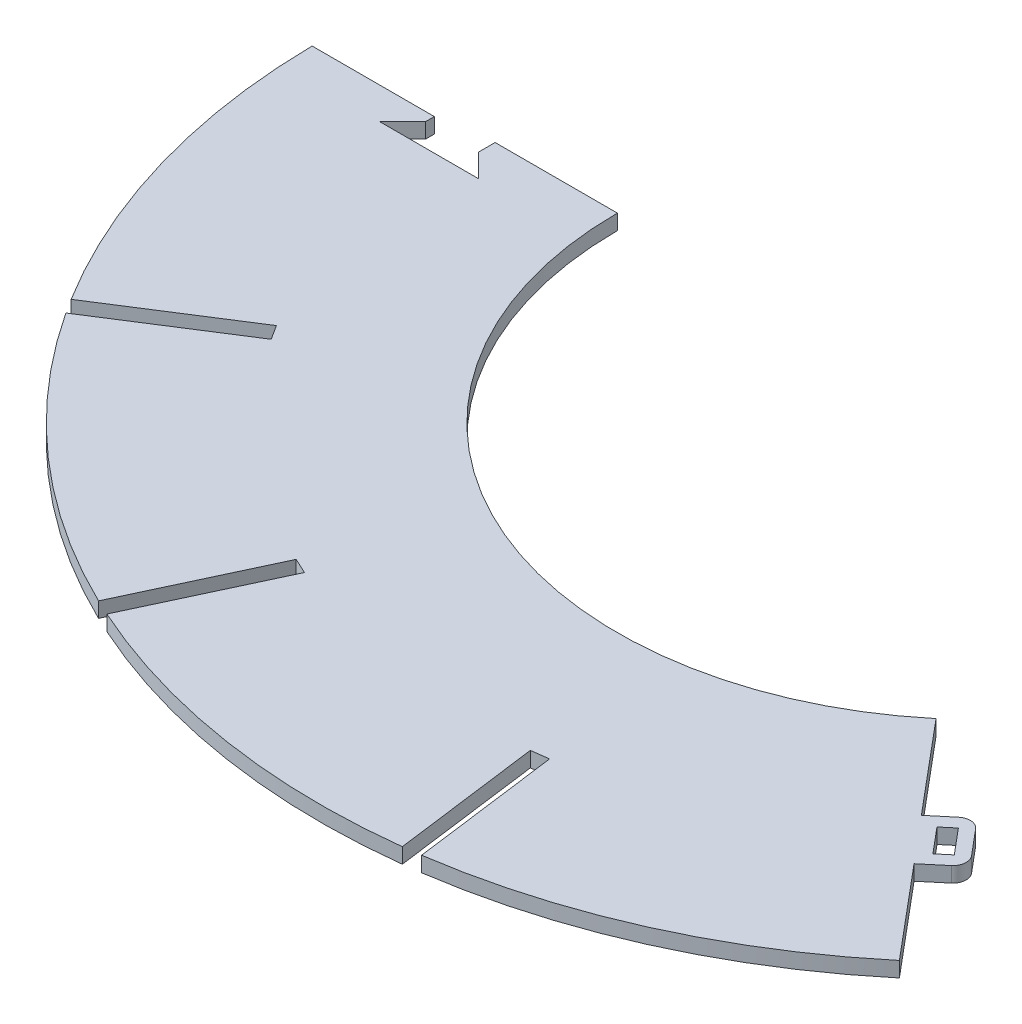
ISO-10303-21;
HEADER;
FILE_DESCRIPTION(('STEP AP214'),'2;1');
FILE_NAME('part.step','',(''),(''),'','','');
FILE_SCHEMA(('AUTOMOTIVE_DESIGN { 1 0 10303 214 1 1 1 1 }'));
ENDSEC;
DATA;
#1=APPLICATION_CONTEXT('core data for automotive mechanical design processes');
#2=APPLICATION_PROTOCOL_DEFINITION('international standard','automotive_design',2000,#1);
#3=PRODUCT_CONTEXT('',#1,'mechanical');
#4=PRODUCT('Part','Part','',(#3));
#5=PRODUCT_RELATED_PRODUCT_CATEGORY('part','',(#4));
#6=PRODUCT_DEFINITION_FORMATION('','',#4);
#7=PRODUCT_DEFINITION_CONTEXT('part definition',#1,'design');
#8=PRODUCT_DEFINITION('design','',#6,#7);
#9=PRODUCT_DEFINITION_SHAPE('','',#8);
#10=(LENGTH_UNIT() NAMED_UNIT(*) SI_UNIT(.MILLI.,.METRE.));
#11=(NAMED_UNIT(*) PLANE_ANGLE_UNIT() SI_UNIT($,.RADIAN.));
#12=(NAMED_UNIT(*) SI_UNIT($,.STERADIAN.) SOLID_ANGLE_UNIT());
#13=UNCERTAINTY_MEASURE_WITH_UNIT(LENGTH_MEASURE(1.E-05),#10,'distance_accuracy_value','');
#14=(GEOMETRIC_REPRESENTATION_CONTEXT(3) GLOBAL_UNCERTAINTY_ASSIGNED_CONTEXT((#13)) GLOBAL_UNIT_ASSIGNED_CONTEXT((#10,
#11,#12)) REPRESENTATION_CONTEXT('',''));
#15=CARTESIAN_POINT('',(0.,0.,0.));
#16=DIRECTION('',(0.,0.,1.));
#17=DIRECTION('',(1.,0.,0.));
#18=AXIS2_PLACEMENT_3D('',#15,#16,#17);
#19=CARTESIAN_POINT('',(264.895793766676,23.,315.690513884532));
#20=DIRECTION('',(0.642787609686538,0.,0.766044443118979));
#21=DIRECTION('',(0.766044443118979,0.,-0.642787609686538));
#22=AXIS2_PLACEMENT_3D('',#19,#20,#21);
#23=PLANE('',#22);
#24=DIRECTION('',(-0.766044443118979,0.,0.642787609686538));
#25=VECTOR('',#24,1.);
#26=CARTESIAN_POINT('',(264.895793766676,0.,315.690513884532));
#27=LINE('',#26,#25);
#28=CARTESIAN_POINT('',(487.499812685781,0.,128.903563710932));
#29=VERTEX_POINT('',#28);
#30=CARTESIAN_POINT('',(469.880790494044,0.,143.687678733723));
#31=VERTEX_POINT('',#30);
#32=EDGE_CURVE('E351',#29,#31,#27,.T.);
#33=ORIENTED_EDGE('',*,*,#32,.F.);
#34=DIRECTION('',(0.,-1.,0.));
#35=VECTOR('',#34,1.);
#36=CARTESIAN_POINT('',(487.499812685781,23.,128.903563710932));
#37=LINE('',#36,#35);
#38=CARTESIAN_POINT('',(487.499812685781,23.,128.903563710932));
#39=VERTEX_POINT('',#38);
#40=EDGE_CURVE('E11',#39,#29,#37,.T.);
#41=ORIENTED_EDGE('',*,*,#40,.F.);
#42=DIRECTION('',(-0.766044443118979,0.,0.642787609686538));
#43=VECTOR('',#42,1.);
#44=CARTESIAN_POINT('',(264.895793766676,23.,315.690513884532));
#45=LINE('',#44,#43);
#46=CARTESIAN_POINT('',(469.880790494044,23.,143.687678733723));
#47=VERTEX_POINT('',#46);
#48=EDGE_CURVE('E257',#39,#47,#45,.T.);
#49=ORIENTED_EDGE('',*,*,#48,.T.);
#50=DIRECTION('',(0.,-1.,0.));
#51=VECTOR('',#50,1.);
#52=CARTESIAN_POINT('',(469.880790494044,23.,143.687678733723));
#53=LINE('',#52,#51);
#54=EDGE_CURVE('E53',#47,#31,#53,.T.);
#55=ORIENTED_EDGE('',*,*,#54,.T.);
#56=EDGE_LOOP('',(#33,#41,#49,#55));
#57=FACE_BOUND('',#56,.T.);
#58=ADVANCED_FACE('F34',(#57),#23,.T.);
#59=CARTESIAN_POINT('',(222.604018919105,23.,-186.7869501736));
#60=DIRECTION('',(0.766044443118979,0.,-0.642787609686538));
#61=DIRECTION('',(-0.642787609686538,0.,-0.766044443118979));
#62=AXIS2_PLACEMENT_3D('',#59,#60,#61);
#63=PLANE('',#62);
#64=DIRECTION('',(0.642787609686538,0.,0.766044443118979));
#65=VECTOR('',#64,1.);
#66=CARTESIAN_POINT('',(222.604018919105,0.,-186.7869501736));
#67=LINE('',#66,#65);
#68=CARTESIAN_POINT('',(519.639193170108,0.,167.205785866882));
#69=VERTEX_POINT('',#68);
#70=EDGE_CURVE('E263',#29,#69,#67,.T.);
#71=ORIENTED_EDGE('',*,*,#70,.T.);
#72=DIRECTION('',(0.,-1.,0.));
#73=VECTOR('',#72,1.);
#74=CARTESIAN_POINT('',(519.639193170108,23.,167.205785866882));
#75=LINE('',#74,#73);
#76=CARTESIAN_POINT('',(519.639193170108,23.,167.205785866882));
#77=VERTEX_POINT('',#76);
#78=EDGE_CURVE('E44',#77,#69,#75,.T.);
#79=ORIENTED_EDGE('',*,*,#78,.F.);
#80=DIRECTION('',(0.642787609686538,0.,0.766044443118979));
#81=VECTOR('',#80,1.);
#82=CARTESIAN_POINT('',(222.604018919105,23.,-186.7869501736));
#83=LINE('',#82,#81);
#84=EDGE_CURVE('E251',#39,#77,#83,.T.);
#85=ORIENTED_EDGE('',*,*,#84,.F.);
#86=ORIENTED_EDGE('',*,*,#40,.T.);
#87=EDGE_LOOP('',(#71,#79,#85,#86));
#88=FACE_BOUND('',#87,.T.);
#89=ADVANCED_FACE('F261',(#88),#63,.F.);
#90=CARTESIAN_POINT('',(297.035174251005,23.,353.992736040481));
#91=DIRECTION('',(-0.64278760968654,0.,-0.766044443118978));
#92=DIRECTION('',(-0.766044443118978,0.,0.64278760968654));
#93=AXIS2_PLACEMENT_3D('',#90,#91,#92);
#94=PLANE('',#93);
#95=DIRECTION('',(0.766044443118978,0.,-0.64278760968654));
#96=VECTOR('',#95,1.);
#97=CARTESIAN_POINT('',(297.035174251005,0.,353.992736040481));
#98=LINE('',#97,#96);
#99=CARTESIAN_POINT('',(502.020170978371,0.,181.989900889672));
#100=VERTEX_POINT('',#99);
#101=EDGE_CURVE('E354',#100,#69,#98,.T.);
#102=ORIENTED_EDGE('',*,*,#101,.F.);
#103=DIRECTION('',(0.,-1.,0.));
#104=VECTOR('',#103,1.);
#105=CARTESIAN_POINT('',(502.020170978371,23.,181.989900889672));
#106=LINE('',#105,#104);
#107=CARTESIAN_POINT('',(502.020170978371,23.,181.989900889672));
#108=VERTEX_POINT('',#107);
#109=EDGE_CURVE('E150',#108,#100,#106,.T.);
#110=ORIENTED_EDGE('',*,*,#109,.F.);
#111=DIRECTION('',(0.766044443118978,0.,-0.64278760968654));
#112=VECTOR('',#111,1.);
#113=CARTESIAN_POINT('',(297.035174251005,23.,353.992736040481));
#114=LINE('',#113,#112);
#115=EDGE_CURVE('E256',#108,#77,#114,.T.);
#116=ORIENTED_EDGE('',*,*,#115,.T.);
#117=ORIENTED_EDGE('',*,*,#78,.T.);
#118=EDGE_LOOP('',(#102,#110,#116,#117));
#119=FACE_BOUND('',#118,.T.);
#120=ADVANCED_FACE('F267',(#119),#94,.T.);
#121=CARTESIAN_POINT('',(-26.3817389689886,23.,-418.95408282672));
#122=DIRECTION('',(0.,-1.,0.));
#123=DIRECTION('',(0.,0.,-1.));
#124=AXIS2_PLACEMENT_3D('',#121,#122,#123);
#125=CYLINDRICAL_SURFACE('',#124,1000.);
#126=CARTESIAN_POINT('',(-26.3817389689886,0.,-418.95408282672));
#127=DIRECTION('',(0.,1.,0.));
#128=DIRECTION('',(0.,0.,1.));
#129=AXIS2_PLACEMENT_3D('',#126,#127,#128);
#130=CIRCLE('',#129,1000.);
#131=CARTESIAN_POINT('',(-876.686810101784,0.,107.336032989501));
#132=VERTEX_POINT('',#131);
#133=CARTESIAN_POINT('',(-1026.30973637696,0.,-406.954082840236));
#134=VERTEX_POINT('',#133);
#135=EDGE_CURVE('E274',#132,#134,#130,.F.);
#136=ORIENTED_EDGE('',*,*,#135,.F.);
#137=DIRECTION('',(0.,-1.,0.));
#138=VECTOR('',#137,1.);
#139=CARTESIAN_POINT('',(-876.686810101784,23.,107.336032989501));
#140=LINE('',#139,#138);
#141=CARTESIAN_POINT('',(-876.686810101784,23.,107.336032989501));
#142=VERTEX_POINT('',#141);
#143=EDGE_CURVE('E38',#142,#132,#140,.T.);
#144=ORIENTED_EDGE('',*,*,#143,.F.);
#145=CARTESIAN_POINT('',(-26.3817389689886,23.,-418.95408282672));
#146=DIRECTION('',(0.,1.,0.));
#147=DIRECTION('',(0.,0.,1.));
#148=AXIS2_PLACEMENT_3D('',#145,#146,#147);
#149=CIRCLE('',#148,1000.);
#150=CARTESIAN_POINT('',(-1026.30973637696,23.,-406.954082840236));
#151=VERTEX_POINT('',#150);
#152=EDGE_CURVE('E359',#142,#151,#149,.F.);
#153=ORIENTED_EDGE('',*,*,#152,.T.);
#154=DIRECTION('',(0.,-1.,0.));
#155=VECTOR('',#154,1.);
#156=CARTESIAN_POINT('',(-1026.30973637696,23.,-406.954082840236));
#157=LINE('',#156,#155);
#158=EDGE_CURVE('E270',#151,#134,#157,.T.);
#159=ORIENTED_EDGE('',*,*,#158,.T.);
#160=EDGE_LOOP('',(#136,#144,#153,#159));
#161=FACE_BOUND('',#160,.T.);
#162=ADVANCED_FACE('F36',(#161),#125,.T.);
#163=CARTESIAN_POINT('',(-204.451735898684,23.,-320.92494105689));
#164=DIRECTION('',(0.537299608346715,0.,0.843391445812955));
#165=DIRECTION('',(0.843391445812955,0.,-0.537299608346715));
#166=AXIS2_PLACEMENT_3D('',#163,#164,#165);
#167=PLANE('',#166);
#168=DIRECTION('',(-0.843391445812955,0.,0.537299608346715));
#169=VECTOR('',#168,1.);
#170=CARTESIAN_POINT('',(-204.451735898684,0.,-320.92494105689));
#171=LINE('',#170,#169);
#172=CARTESIAN_POINT('',(-686.909718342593,0.,-13.56530835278));
#173=VERTEX_POINT('',#172);
#174=EDGE_CURVE('E277',#173,#132,#171,.T.);
#175=ORIENTED_EDGE('',*,*,#174,.F.);
#176=DIRECTION('',(0.,-1.,0.));
#177=VECTOR('',#176,1.);
#178=CARTESIAN_POINT('',(-686.909718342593,23.,-13.56530835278));
#179=LINE('',#178,#177);
#180=CARTESIAN_POINT('',(-686.909718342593,23.,-13.56530835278));
#181=VERTEX_POINT('',#180);
#182=EDGE_CURVE('E419',#181,#173,#179,.T.);
#183=ORIENTED_EDGE('',*,*,#182,.F.);
#184=DIRECTION('',(-0.843391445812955,0.,0.537299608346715));
#185=VECTOR('',#184,1.);
#186=CARTESIAN_POINT('',(-204.451735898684,23.,-320.92494105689));
#187=LINE('',#186,#185);
#188=EDGE_CURVE('E428',#181,#142,#187,.T.);
#189=ORIENTED_EDGE('',*,*,#188,.T.);
#190=ORIENTED_EDGE('',*,*,#143,.T.);
#191=EDGE_LOOP('',(#175,#183,#189,#190));
#192=FACE_BOUND('',#191,.T.);
#193=ADVANCED_FACE('F426',(#192),#167,.T.);
#194=CARTESIAN_POINT('',(-482.847053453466,23.,307.187186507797));
#195=DIRECTION('',(0.843724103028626,0.,-0.536777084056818));
#196=DIRECTION('',(-0.536777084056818,0.,-0.843724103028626));
#197=AXIS2_PLACEMENT_3D('',#194,#195,#196);
#198=PLANE('',#197);
#199=DIRECTION('',(0.536777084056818,0.,0.843724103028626));
#200=VECTOR('',#199,1.);
#201=CARTESIAN_POINT('',(-482.847053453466,0.,307.187186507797));
#202=LINE('',#201,#200);
#203=CARTESIAN_POINT('',(-672.953511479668,0.,8.37152253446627));
#204=VERTEX_POINT('',#203);
#205=EDGE_CURVE('E280',#173,#204,#202,.T.);
#206=ORIENTED_EDGE('',*,*,#205,.T.);
#207=DIRECTION('',(0.,-1.,0.));
#208=VECTOR('',#207,1.);
#209=CARTESIAN_POINT('',(-672.953511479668,23.,8.37152253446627));
#210=LINE('',#209,#208);
#211=CARTESIAN_POINT('',(-672.953511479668,23.,8.37152253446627));
#212=VERTEX_POINT('',#211);
#213=EDGE_CURVE('E417',#212,#204,#210,.T.);
#214=ORIENTED_EDGE('',*,*,#213,.F.);
#215=DIRECTION('',(0.536777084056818,0.,0.843724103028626));
#216=VECTOR('',#215,1.);
#217=CARTESIAN_POINT('',(-482.847053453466,23.,307.187186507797));
#218=LINE('',#217,#216);
#219=EDGE_CURVE('E446',#181,#212,#218,.T.);
#220=ORIENTED_EDGE('',*,*,#219,.F.);
#221=ORIENTED_EDGE('',*,*,#182,.T.);
#222=EDGE_LOOP('',(#206,#214,#220,#221));
#223=FACE_BOUND('',#222,.T.);
#224=ADVANCED_FACE('F436',(#223),#198,.F.);
#225=CARTESIAN_POINT('',(-190.481946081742,23.,-298.996763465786));
#226=DIRECTION('',(0.537299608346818,0.,0.843391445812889));
#227=DIRECTION('',(0.843391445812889,0.,-0.537299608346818));
#228=AXIS2_PLACEMENT_3D('',#225,#226,#227);
#229=PLANE('',#228);
#230=DIRECTION('',(-0.843391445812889,0.,0.537299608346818));
#231=VECTOR('',#230,1.);
#232=CARTESIAN_POINT('',(-190.481946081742,0.,-298.996763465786));
#233=LINE('',#232,#231);
#234=CARTESIAN_POINT('',(-862.717020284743,0.,129.264210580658));
#235=VERTEX_POINT('',#234);
#236=EDGE_CURVE('E282',#204,#235,#233,.T.);
#237=ORIENTED_EDGE('',*,*,#236,.T.);
#238=DIRECTION('',(0.,-1.,0.));
#239=VECTOR('',#238,1.);
#240=CARTESIAN_POINT('',(-862.717020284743,23.,129.264210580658));
#241=LINE('',#240,#239);
#242=CARTESIAN_POINT('',(-862.717020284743,23.,129.264210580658));
#243=VERTEX_POINT('',#242);
#244=EDGE_CURVE('E415',#243,#235,#241,.T.);
#245=ORIENTED_EDGE('',*,*,#244,.F.);
#246=DIRECTION('',(-0.843391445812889,0.,0.537299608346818));
#247=VECTOR('',#246,1.);
#248=CARTESIAN_POINT('',(-190.481946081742,23.,-298.996763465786));
#249=LINE('',#248,#247);
#250=EDGE_CURVE('E441',#212,#243,#249,.T.);
#251=ORIENTED_EDGE('',*,*,#250,.F.);
#252=ORIENTED_EDGE('',*,*,#213,.T.);
#253=EDGE_LOOP('',(#237,#245,#251,#252));
#254=FACE_BOUND('',#253,.T.);
#255=ADVANCED_FACE('F439',(#254),#229,.F.);
#256=CARTESIAN_POINT('',(-26.3817389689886,23.,-418.95408282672));
#257=DIRECTION('',(0.,-1.,0.));
#258=DIRECTION('',(0.,0.,-1.));
#259=AXIS2_PLACEMENT_3D('',#256,#257,#258);
#260=CYLINDRICAL_SURFACE('',#259,1000.);
#261=CARTESIAN_POINT('',(-26.3817389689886,0.,-418.95408282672));
#262=DIRECTION('',(0.,1.,0.));
#263=DIRECTION('',(0.,0.,1.));
#264=AXIS2_PLACEMENT_3D('',#261,#262,#263);
#265=CIRCLE('',#264,1000.);
#266=CARTESIAN_POINT('',(-460.746289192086,0.,481.78308056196));
#267=VERTEX_POINT('',#266);
#268=EDGE_CURVE('E285',#267,#235,#265,.F.);
#269=ORIENTED_EDGE('',*,*,#268,.F.);
#270=DIRECTION('',(0.,-1.,0.));
#271=VECTOR('',#270,1.);
#272=CARTESIAN_POINT('',(-460.746289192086,23.,481.78308056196));
#273=LINE('',#272,#271);
#274=CARTESIAN_POINT('',(-460.746289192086,23.,481.78308056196));
#275=VERTEX_POINT('',#274);
#276=EDGE_CURVE('E413',#275,#267,#273,.T.);
#277=ORIENTED_EDGE('',*,*,#276,.F.);
#278=CARTESIAN_POINT('',(-26.3817389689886,23.,-418.95408282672));
#279=DIRECTION('',(0.,1.,0.));
#280=DIRECTION('',(0.,0.,1.));
#281=AXIS2_PLACEMENT_3D('',#278,#279,#280);
#282=CIRCLE('',#281,1000.);
#283=EDGE_CURVE('E445',#275,#243,#282,.F.);
#284=ORIENTED_EDGE('',*,*,#283,.T.);
#285=ORIENTED_EDGE('',*,*,#244,.T.);
#286=EDGE_LOOP('',(#269,#277,#284,#285));
#287=FACE_BOUND('',#286,.T.);
#288=ADVANCED_FACE('F615',(#287),#260,.T.);
#289=CARTESIAN_POINT('',(-193.920521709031,23.,-90.4266243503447));
#290=DIRECTION('',(0.90630778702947,0.,0.422618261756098));
#291=DIRECTION('',(0.422618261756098,0.,-0.90630778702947));
#292=AXIS2_PLACEMENT_3D('',#289,#290,#291);
#293=PLANE('',#292);
#294=DIRECTION('',(-0.422618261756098,0.,0.90630778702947));
#295=VECTOR('',#294,1.);
#296=CARTESIAN_POINT('',(-193.920521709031,0.,-90.4266243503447));
#297=LINE('',#296,#295);
#298=CARTESIAN_POINT('',(-365.650287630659,0.,277.849047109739));
#299=VERTEX_POINT('',#298);
#300=EDGE_CURVE('E288',#299,#267,#297,.T.);
#301=ORIENTED_EDGE('',*,*,#300,.F.);
#302=DIRECTION('',(0.,-1.,0.));
#303=VECTOR('',#302,1.);
#304=CARTESIAN_POINT('',(-365.650287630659,23.,277.849047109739));
#305=LINE('',#304,#303);
#306=CARTESIAN_POINT('',(-365.650287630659,23.,277.849047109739));
#307=VERTEX_POINT('',#306);
#308=EDGE_CURVE('E411',#307,#299,#305,.T.);
#309=ORIENTED_EDGE('',*,*,#308,.F.);
#310=DIRECTION('',(-0.422618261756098,0.,0.90630778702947));
#311=VECTOR('',#310,1.);
#312=CARTESIAN_POINT('',(-193.920521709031,23.,-90.4266243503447));
#313=LINE('',#312,#311);
#314=EDGE_CURVE('E448',#307,#275,#313,.T.);
#315=ORIENTED_EDGE('',*,*,#314,.T.);
#316=ORIENTED_EDGE('',*,*,#276,.T.);
#317=EDGE_LOOP('',(#301,#309,#315,#316));
#318=FACE_BOUND('',#317,.T.);
#319=ADVANCED_FACE('F611',(#318),#293,.T.);
#320=CARTESIAN_POINT('',(-171.72976591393,23.,368.275671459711));
#321=DIRECTION('',(0.422618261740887,0.,-0.906307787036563));
#322=DIRECTION('',(-0.906307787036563,0.,-0.422618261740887));
#323=AXIS2_PLACEMENT_3D('',#320,#321,#322);
#324=PLANE('',#323);
#325=DIRECTION('',(0.906307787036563,0.,0.422618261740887));
#326=VECTOR('',#325,1.);
#327=CARTESIAN_POINT('',(-171.72976591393,0.,368.275671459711));
#328=LINE('',#327,#326);
#329=CARTESIAN_POINT('',(-342.086285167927,0.,288.8371219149));
#330=VERTEX_POINT('',#329);
#331=EDGE_CURVE('E291',#299,#330,#328,.T.);
#332=ORIENTED_EDGE('',*,*,#331,.T.);
#333=DIRECTION('',(0.,-1.,0.));
#334=VECTOR('',#333,1.);
#335=CARTESIAN_POINT('',(-342.086285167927,23.,288.8371219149));
#336=LINE('',#335,#334);
#337=CARTESIAN_POINT('',(-342.086285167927,23.,288.8371219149));
#338=VERTEX_POINT('',#337);
#339=EDGE_CURVE('E408',#338,#330,#336,.T.);
#340=ORIENTED_EDGE('',*,*,#339,.F.);
#341=DIRECTION('',(0.906307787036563,0.,0.422618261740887));
#342=VECTOR('',#341,1.);
#343=CARTESIAN_POINT('',(-171.72976591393,23.,368.275671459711));
#344=LINE('',#343,#342);
#345=EDGE_CURVE('E455',#307,#338,#344,.T.);
#346=ORIENTED_EDGE('',*,*,#345,.F.);
#347=ORIENTED_EDGE('',*,*,#308,.T.);
#348=EDGE_LOOP('',(#332,#340,#346,#347));
#349=FACE_BOUND('',#348,.T.);
#350=ADVANCED_FACE('F607',(#349),#324,.F.);
#351=CARTESIAN_POINT('',(-170.356519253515,23.,-79.4385495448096));
#352=DIRECTION('',(0.906307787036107,0.,0.422618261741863));
#353=DIRECTION('',(0.422618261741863,0.,-0.906307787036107));
#354=AXIS2_PLACEMENT_3D('',#351,#352,#353);
#355=PLANE('',#354);
#356=DIRECTION('',(-0.422618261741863,0.,0.906307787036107));
#357=VECTOR('',#356,1.);
#358=CARTESIAN_POINT('',(-170.356519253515,0.,-79.4385495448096));
#359=LINE('',#358,#357);
#360=CARTESIAN_POINT('',(-437.182286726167,0.,492.771155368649));
#361=VERTEX_POINT('',#360);
#362=EDGE_CURVE('E293',#330,#361,#359,.T.);
#363=ORIENTED_EDGE('',*,*,#362,.T.);
#364=DIRECTION('',(0.,-1.,0.));
#365=VECTOR('',#364,1.);
#366=CARTESIAN_POINT('',(-437.182286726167,23.,492.771155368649));
#367=LINE('',#366,#365);
#368=CARTESIAN_POINT('',(-437.182286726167,23.,492.771155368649));
#369=VERTEX_POINT('',#368);
#370=EDGE_CURVE('E406',#369,#361,#367,.T.);
#371=ORIENTED_EDGE('',*,*,#370,.F.);
#372=DIRECTION('',(-0.422618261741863,0.,0.906307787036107));
#373=VECTOR('',#372,1.);
#374=CARTESIAN_POINT('',(-170.356519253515,23.,-79.4385495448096));
#375=LINE('',#374,#373);
#376=EDGE_CURVE('E457',#338,#369,#375,.T.);
#377=ORIENTED_EDGE('',*,*,#376,.F.);
#378=ORIENTED_EDGE('',*,*,#339,.T.);
#379=EDGE_LOOP('',(#363,#371,#377,#378));
#380=FACE_BOUND('',#379,.T.);
#381=ADVANCED_FACE('F603',(#380),#355,.F.);
#382=CARTESIAN_POINT('',(-26.3817389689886,23.,-418.95408282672));
#383=DIRECTION('',(0.,-1.,0.));
#384=DIRECTION('',(0.,0.,-1.));
#385=AXIS2_PLACEMENT_3D('',#382,#383,#384);
#386=CYLINDRICAL_SURFACE('',#385,1000.);
#387=CARTESIAN_POINT('',(-26.3817389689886,0.,-418.95408282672));
#388=DIRECTION('',(0.,1.,0.));
#389=DIRECTION('',(0.,0.,1.));
#390=AXIS2_PLACEMENT_3D('',#387,#388,#389);
#391=CIRCLE('',#390,1000.);
#392=CARTESIAN_POINT('',(91.2446401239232,0.,574.103838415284));
#393=VERTEX_POINT('',#392);
#394=EDGE_CURVE('E296',#393,#361,#391,.F.);
#395=ORIENTED_EDGE('',*,*,#394,.F.);
#396=DIRECTION('',(0.,-1.,0.));
#397=VECTOR('',#396,1.);
#398=CARTESIAN_POINT('',(91.2446401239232,23.,574.103838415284));
#399=LINE('',#398,#397);
#400=CARTESIAN_POINT('',(91.2446401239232,23.,574.103838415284));
#401=VERTEX_POINT('',#400);
#402=EDGE_CURVE('E404',#401,#393,#399,.T.);
#403=ORIENTED_EDGE('',*,*,#402,.F.);
#404=CARTESIAN_POINT('',(-26.3817389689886,23.,-418.95408282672));
#405=DIRECTION('',(0.,1.,0.));
#406=DIRECTION('',(0.,0.,1.));
#407=AXIS2_PLACEMENT_3D('',#404,#405,#406);
#408=CIRCLE('',#407,1000.);
#409=EDGE_CURVE('E459',#401,#369,#408,.F.);
#410=ORIENTED_EDGE('',*,*,#409,.T.);
#411=ORIENTED_EDGE('',*,*,#370,.T.);
#412=EDGE_LOOP('',(#395,#403,#410,#411));
#413=FACE_BOUND('',#412,.T.);
#414=ADVANCED_FACE('F599',(#413),#386,.T.);
#415=CARTESIAN_POINT('',(15.3955936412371,23.,-2.02686835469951));
#416=DIRECTION('',(0.991444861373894,0.,-0.130526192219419));
#417=DIRECTION('',(-0.130526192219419,0.,-0.991444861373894));
#418=AXIS2_PLACEMENT_3D('',#415,#416,#417);
#419=PLANE('',#418);
#420=DIRECTION('',(0.130526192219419,0.,0.991444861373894));
#421=VECTOR('',#420,1.);
#422=CARTESIAN_POINT('',(15.3955936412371,0.,-2.02686835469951));
#423=LINE('',#422,#421);
#424=CARTESIAN_POINT('',(61.8741180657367,0.,351.01257469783));
#425=VERTEX_POINT('',#424);
#426=EDGE_CURVE('E299',#425,#393,#423,.T.);
#427=ORIENTED_EDGE('',*,*,#426,.F.);
#428=DIRECTION('',(0.,-1.,0.));
#429=VECTOR('',#428,1.);
#430=CARTESIAN_POINT('',(61.8741180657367,23.,351.01257469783));
#431=LINE('',#430,#429);
#432=CARTESIAN_POINT('',(61.8741180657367,23.,351.01257469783));
#433=VERTEX_POINT('',#432);
#434=EDGE_CURVE('E402',#433,#425,#431,.T.);
#435=ORIENTED_EDGE('',*,*,#434,.F.);
#436=DIRECTION('',(0.130526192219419,0.,0.991444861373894));
#437=VECTOR('',#436,1.);
#438=CARTESIAN_POINT('',(15.3955936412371,23.,-2.02686835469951));
#439=LINE('',#438,#437);
#440=EDGE_CURVE('E462',#433,#401,#439,.T.);
#441=ORIENTED_EDGE('',*,*,#440,.T.);
#442=ORIENTED_EDGE('',*,*,#402,.T.);
#443=EDGE_LOOP('',(#427,#435,#441,#442));
#444=FACE_BOUND('',#443,.T.);
#445=ADVANCED_FACE('F595',(#444),#419,.T.);
#446=CARTESIAN_POINT('',(46.4785244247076,23.,353.039443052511));
#447=DIRECTION('',(-0.13052619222,0.,-0.991444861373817));
#448=DIRECTION('',(-0.991444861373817,0.,0.13052619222));
#449=AXIS2_PLACEMENT_3D('',#446,#447,#448);
#450=PLANE('',#449);
#451=DIRECTION('',(0.991444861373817,0.,-0.13052619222));
#452=VECTOR('',#451,1.);
#453=CARTESIAN_POINT('',(46.4785244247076,0.,353.039443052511));
#454=LINE('',#453,#452);
#455=CARTESIAN_POINT('',(87.6516844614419,0.,347.618893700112));
#456=VERTEX_POINT('',#455);
#457=EDGE_CURVE('E302',#425,#456,#454,.T.);
#458=ORIENTED_EDGE('',*,*,#457,.T.);
#459=DIRECTION('',(0.,-1.,0.));
#460=VECTOR('',#459,1.);
#461=CARTESIAN_POINT('',(87.6516844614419,23.,347.618893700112));
#462=LINE('',#461,#460);
#463=CARTESIAN_POINT('',(87.6516844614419,23.,347.618893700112));
#464=VERTEX_POINT('',#463);
#465=EDGE_CURVE('E399',#464,#456,#462,.T.);
#466=ORIENTED_EDGE('',*,*,#465,.F.);
#467=DIRECTION('',(0.991444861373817,0.,-0.13052619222));
#468=VECTOR('',#467,1.);
#469=CARTESIAN_POINT('',(46.4785244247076,23.,353.039443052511));
#470=LINE('',#469,#468);
#471=EDGE_CURVE('E465',#433,#464,#470,.T.);
#472=ORIENTED_EDGE('',*,*,#471,.F.);
#473=ORIENTED_EDGE('',*,*,#434,.T.);
#474=EDGE_LOOP('',(#458,#466,#472,#473));
#475=FACE_BOUND('',#474,.T.);
#476=ADVANCED_FACE('F591',(#475),#450,.F.);
#477=CARTESIAN_POINT('',(41.1731600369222,23.,-5.42054935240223));
#478=DIRECTION('',(0.991444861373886,0.,-0.13052619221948));
#479=DIRECTION('',(-0.13052619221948,0.,-0.991444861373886));
#480=AXIS2_PLACEMENT_3D('',#477,#478,#479);
#481=PLANE('',#480);
#482=DIRECTION('',(0.13052619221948,0.,0.991444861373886));
#483=VECTOR('',#482,1.);
#484=CARTESIAN_POINT('',(41.1731600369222,0.,-5.42054935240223));
#485=LINE('',#484,#483);
#486=CARTESIAN_POINT('',(117.022206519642,0.,570.710157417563));
#487=VERTEX_POINT('',#486);
#488=EDGE_CURVE('E304',#456,#487,#485,.T.);
#489=ORIENTED_EDGE('',*,*,#488,.T.);
#490=DIRECTION('',(0.,-1.,0.));
#491=VECTOR('',#490,1.);
#492=CARTESIAN_POINT('',(117.022206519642,23.,570.710157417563));
#493=LINE('',#492,#491);
#494=CARTESIAN_POINT('',(117.022206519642,23.,570.710157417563));
#495=VERTEX_POINT('',#494);
#496=EDGE_CURVE('E397',#495,#487,#493,.T.);
#497=ORIENTED_EDGE('',*,*,#496,.F.);
#498=DIRECTION('',(0.13052619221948,0.,0.991444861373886));
#499=VECTOR('',#498,1.);
#500=CARTESIAN_POINT('',(41.1731600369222,23.,-5.42054935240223));
#501=LINE('',#500,#499);
#502=EDGE_CURVE('E467',#464,#495,#501,.T.);
#503=ORIENTED_EDGE('',*,*,#502,.F.);
#504=ORIENTED_EDGE('',*,*,#465,.T.);
#505=EDGE_LOOP('',(#489,#497,#503,#504));
#506=FACE_BOUND('',#505,.T.);
#507=ADVANCED_FACE('F587',(#506),#481,.F.);
#508=CARTESIAN_POINT('',(-26.3817389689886,23.,-418.95408282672));
#509=DIRECTION('',(0.,-1.,0.));
#510=DIRECTION('',(0.,0.,-1.));
#511=AXIS2_PLACEMENT_3D('',#508,#509,#510);
#512=CYLINDRICAL_SURFACE('',#511,1000.);
#513=CARTESIAN_POINT('',(-26.3817389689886,0.,-418.95408282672));
#514=DIRECTION('',(0.,1.,0.));
#515=DIRECTION('',(0.,0.,1.));
#516=AXIS2_PLACEMENT_3D('',#513,#514,#515);
#517=CIRCLE('',#516,1000.);
#518=CARTESIAN_POINT('',(616.405870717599,0.,347.090360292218));
#519=VERTEX_POINT('',#518);
#520=EDGE_CURVE('E307',#519,#487,#517,.F.);
#521=ORIENTED_EDGE('',*,*,#520,.F.);
#522=DIRECTION('',(0.,-1.,0.));
#523=VECTOR('',#522,1.);
#524=CARTESIAN_POINT('',(616.405870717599,23.,347.090360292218));
#525=LINE('',#524,#523);
#526=CARTESIAN_POINT('',(616.405870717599,23.,347.090360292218));
#527=VERTEX_POINT('',#526);
#528=EDGE_CURVE('E395',#527,#519,#525,.T.);
#529=ORIENTED_EDGE('',*,*,#528,.F.);
#530=CARTESIAN_POINT('',(-26.3817389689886,23.,-418.95408282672));
#531=DIRECTION('',(0.,1.,0.));
#532=DIRECTION('',(0.,0.,1.));
#533=AXIS2_PLACEMENT_3D('',#530,#531,#532);
#534=CIRCLE('',#533,1000.);
#535=EDGE_CURVE('E469',#527,#495,#534,.F.);
#536=ORIENTED_EDGE('',*,*,#535,.T.);
#537=ORIENTED_EDGE('',*,*,#496,.T.);
#538=EDGE_LOOP('',(#521,#529,#536,#537));
#539=FACE_BOUND('',#538,.T.);
#540=ADVANCED_FACE('F583',(#539),#512,.T.);
#541=CARTESIAN_POINT('',(190.813174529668,23.,-160.111264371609));
#542=DIRECTION('',(0.766044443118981,0.,-0.642787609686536));
#543=DIRECTION('',(-0.642787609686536,0.,-0.766044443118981));
#544=AXIS2_PLACEMENT_3D('',#541,#542,#543);
#545=PLANE('',#544);
#546=DIRECTION('',(0.642787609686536,0.,0.766044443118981));
#547=VECTOR('',#546,1.);
#548=CARTESIAN_POINT('',(190.813174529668,0.,-160.111264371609));
#549=LINE('',#548,#547);
#550=CARTESIAN_POINT('',(500.704100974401,0.,209.202360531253));
#551=VERTEX_POINT('',#550);
#552=EDGE_CURVE('E310',#551,#519,#549,.T.);
#553=ORIENTED_EDGE('',*,*,#552,.F.);
#554=DIRECTION('',(0.,-1.,0.));
#555=VECTOR('',#554,1.);
#556=CARTESIAN_POINT('',(500.704100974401,23.,209.202360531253));
#557=LINE('',#556,#555);
#558=CARTESIAN_POINT('',(500.704100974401,23.,209.202360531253));
#559=VERTEX_POINT('',#558);
#560=EDGE_CURVE('E393',#559,#551,#557,.T.);
#561=ORIENTED_EDGE('',*,*,#560,.F.);
#562=DIRECTION('',(0.642787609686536,0.,0.766044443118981));
#563=VECTOR('',#562,1.);
#564=CARTESIAN_POINT('',(190.813174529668,23.,-160.111264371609));
#565=LINE('',#564,#563);
#566=EDGE_CURVE('E472',#559,#527,#565,.T.);
#567=ORIENTED_EDGE('',*,*,#566,.T.);
#568=ORIENTED_EDGE('',*,*,#528,.T.);
#569=EDGE_LOOP('',(#553,#561,#567,#568));
#570=FACE_BOUND('',#569,.T.);
#571=ADVANCED_FACE('F579',(#570),#545,.T.);
#572=CARTESIAN_POINT('',(309.890926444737,23.,369.313624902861));
#573=DIRECTION('',(-0.642787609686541,0.,-0.766044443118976));
#574=DIRECTION('',(-0.766044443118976,0.,0.642787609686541));
#575=AXIS2_PLACEMENT_3D('',#572,#573,#574);
#576=PLANE('',#575);
#577=DIRECTION('',(0.766044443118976,0.,-0.642787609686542));
#578=VECTOR('',#577,1.);
#579=CARTESIAN_POINT('',(309.890926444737,0.,369.313624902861));
#580=LINE('',#579,#578);
#581=CARTESIAN_POINT('',(531.34587869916,0.,183.490856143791));
#582=VERTEX_POINT('',#581);
#583=EDGE_CURVE('E313',#551,#582,#580,.T.);
#584=ORIENTED_EDGE('',*,*,#583,.T.);
#585=DIRECTION('',(0.,-1.,0.));
#586=VECTOR('',#585,1.);
#587=CARTESIAN_POINT('',(531.34587869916,23.,183.490856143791));
#588=LINE('',#587,#586);
#589=CARTESIAN_POINT('',(531.34587869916,23.,183.490856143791));
#590=VERTEX_POINT('',#589);
#591=EDGE_CURVE('E391',#590,#582,#588,.T.);
#592=ORIENTED_EDGE('',*,*,#591,.F.);
#593=DIRECTION('',(0.766044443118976,0.,-0.642787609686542));
#594=VECTOR('',#593,1.);
#595=CARTESIAN_POINT('',(309.890926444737,23.,369.313624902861));
#596=LINE('',#595,#594);
#597=EDGE_CURVE('E475',#559,#590,#596,.T.);
#598=ORIENTED_EDGE('',*,*,#597,.F.);
#599=ORIENTED_EDGE('',*,*,#560,.T.);
#600=EDGE_LOOP('',(#584,#592,#598,#599));
#601=FACE_BOUND('',#600,.T.);
#602=ADVANCED_FACE('F575',(#601),#576,.F.);
#603=CARTESIAN_POINT('',(518.490126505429,23.,168.169967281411));
#604=DIRECTION('',(0.,-1.,0.));
#605=DIRECTION('',(0.,0.,-1.));
#606=AXIS2_PLACEMENT_3D('',#603,#604,#605);
#607=CYLINDRICAL_SURFACE('',#606,20.);
#608=CARTESIAN_POINT('',(518.490126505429,0.,168.169967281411));
#609=DIRECTION('',(0.,1.,0.));
#610=DIRECTION('',(0.,0.,1.));
#611=AXIS2_PLACEMENT_3D('',#608,#609,#610);
#612=CIRCLE('',#611,20.);
#613=CARTESIAN_POINT('',(533.811015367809,0.,155.31421508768));
#614=VERTEX_POINT('',#613);
#615=EDGE_CURVE('E316',#614,#582,#612,.F.);
#616=ORIENTED_EDGE('',*,*,#615,.F.);
#617=DIRECTION('',(0.,-1.,0.));
#618=VECTOR('',#617,1.);
#619=CARTESIAN_POINT('',(533.811015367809,23.,155.31421508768));
#620=LINE('',#619,#618);
#621=CARTESIAN_POINT('',(533.811015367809,23.,155.31421508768));
#622=VERTEX_POINT('',#621);
#623=EDGE_CURVE('E389',#622,#614,#620,.T.);
#624=ORIENTED_EDGE('',*,*,#623,.F.);
#625=CARTESIAN_POINT('',(518.490126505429,23.,168.169967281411));
#626=DIRECTION('',(0.,1.,0.));
#627=DIRECTION('',(0.,0.,1.));
#628=AXIS2_PLACEMENT_3D('',#625,#626,#627);
#629=CIRCLE('',#628,20.);
#630=EDGE_CURVE('E477',#622,#590,#629,.F.);
#631=ORIENTED_EDGE('',*,*,#630,.T.);
#632=ORIENTED_EDGE('',*,*,#591,.T.);
#633=EDGE_LOOP('',(#616,#624,#631,#632));
#634=FACE_BOUND('',#633,.T.);
#635=ADVANCED_FACE('F571',(#634),#607,.T.);
#636=CARTESIAN_POINT('',(236.775841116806,23.,-198.678520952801));
#637=DIRECTION('',(0.76604444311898,0.,-0.642787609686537));
#638=DIRECTION('',(-0.642787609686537,0.,-0.76604444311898));
#639=AXIS2_PLACEMENT_3D('',#636,#637,#638);
#640=PLANE('',#639);
#641=DIRECTION('',(0.642787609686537,0.,0.76604444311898));
#642=VECTOR('',#641,1.);
#643=CARTESIAN_POINT('',(236.775841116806,0.,-198.678520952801));
#644=LINE('',#643,#642);
#645=CARTESIAN_POINT('',(501.671634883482,0.,117.011992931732));
#646=VERTEX_POINT('',#645);
#647=EDGE_CURVE('E319',#646,#614,#644,.T.);
#648=ORIENTED_EDGE('',*,*,#647,.F.);
#649=DIRECTION('',(0.,-1.,0.));
#650=VECTOR('',#649,1.);
#651=CARTESIAN_POINT('',(501.671634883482,23.,117.011992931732));
#652=LINE('',#651,#650);
#653=CARTESIAN_POINT('',(501.671634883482,23.,117.011992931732));
#654=VERTEX_POINT('',#653);
#655=EDGE_CURVE('E387',#654,#646,#652,.T.);
#656=ORIENTED_EDGE('',*,*,#655,.F.);
#657=DIRECTION('',(0.642787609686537,0.,0.76604444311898));
#658=VECTOR('',#657,1.);
#659=CARTESIAN_POINT('',(236.775841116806,23.,-198.678520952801));
#660=LINE('',#659,#658);
#661=EDGE_CURVE('E480',#654,#622,#660,.T.);
#662=ORIENTED_EDGE('',*,*,#661,.T.);
#663=ORIENTED_EDGE('',*,*,#623,.T.);
#664=EDGE_LOOP('',(#648,#656,#662,#663));
#665=FACE_BOUND('',#664,.T.);
#666=ADVANCED_FACE('F567',(#665),#640,.T.);
#667=CARTESIAN_POINT('',(486.350746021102,23.,129.867745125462));
#668=DIRECTION('',(0.,-1.,0.));
#669=DIRECTION('',(0.,0.,-1.));
#670=AXIS2_PLACEMENT_3D('',#667,#668,#669);
#671=CYLINDRICAL_SURFACE('',#670,20.);
#672=CARTESIAN_POINT('',(486.350746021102,0.,129.867745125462));
#673=DIRECTION('',(0.,1.,0.));
#674=DIRECTION('',(0.,0.,1.));
#675=AXIS2_PLACEMENT_3D('',#672,#673,#674);
#676=CIRCLE('',#675,20.);
#677=CARTESIAN_POINT('',(473.494993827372,0.,114.546856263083));
#678=VERTEX_POINT('',#677);
#679=EDGE_CURVE('E322',#646,#678,#676,.T.);
#680=ORIENTED_EDGE('',*,*,#679,.T.);
#681=DIRECTION('',(0.,-1.,0.));
#682=VECTOR('',#681,1.);
#683=CARTESIAN_POINT('',(473.494993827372,23.,114.546856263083));
#684=LINE('',#683,#682);
#685=CARTESIAN_POINT('',(473.494993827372,23.,114.546856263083));
#686=VERTEX_POINT('',#685);
#687=EDGE_CURVE('E384',#686,#678,#684,.T.);
#688=ORIENTED_EDGE('',*,*,#687,.F.);
#689=CARTESIAN_POINT('',(486.350746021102,23.,129.867745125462));
#690=DIRECTION('',(0.,1.,0.));
#691=DIRECTION('',(0.,0.,1.));
#692=AXIS2_PLACEMENT_3D('',#689,#690,#691);
#693=CIRCLE('',#692,20.);
#694=EDGE_CURVE('E483',#654,#686,#693,.T.);
#695=ORIENTED_EDGE('',*,*,#694,.F.);
#696=ORIENTED_EDGE('',*,*,#655,.T.);
#697=EDGE_LOOP('',(#680,#688,#695,#696));
#698=FACE_BOUND('',#697,.T.);
#699=ADVANCED_FACE('F563',(#698),#671,.T.);
#700=CARTESIAN_POINT('',(252.040041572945,23.,300.369625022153));
#701=DIRECTION('',(0.642787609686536,0.,0.76604444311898));
#702=DIRECTION('',(0.76604444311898,0.,-0.642787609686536));
#703=AXIS2_PLACEMENT_3D('',#700,#701,#702);
#704=PLANE('',#703);
#705=DIRECTION('',(-0.76604444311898,0.,0.642787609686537));
#706=VECTOR('',#705,1.);
#707=CARTESIAN_POINT('',(252.040041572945,0.,300.369625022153));
#708=LINE('',#707,#706);
#709=CARTESIAN_POINT('',(442.853216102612,0.,140.258360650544));
#710=VERTEX_POINT('',#709);
#711=EDGE_CURVE('E324',#678,#710,#708,.T.);
#712=ORIENTED_EDGE('',*,*,#711,.T.);
#713=DIRECTION('',(0.,-1.,0.));
#714=VECTOR('',#713,1.);
#715=CARTESIAN_POINT('',(442.853216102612,23.,140.258360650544));
#716=LINE('',#715,#714);
#717=CARTESIAN_POINT('',(442.853216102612,23.,140.258360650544));
#718=VERTEX_POINT('',#717);
#719=EDGE_CURVE('E382',#718,#710,#716,.T.);
#720=ORIENTED_EDGE('',*,*,#719,.F.);
#721=DIRECTION('',(-0.76604444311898,0.,0.642787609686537));
#722=VECTOR('',#721,1.);
#723=CARTESIAN_POINT('',(252.040041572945,23.,300.369625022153));
#724=LINE('',#723,#722);
#725=EDGE_CURVE('E485',#686,#718,#724,.T.);
#726=ORIENTED_EDGE('',*,*,#725,.F.);
#727=ORIENTED_EDGE('',*,*,#687,.T.);
#728=EDGE_LOOP('',(#712,#720,#726,#727));
#729=FACE_BOUND('',#728,.T.);
#730=ADVANCED_FACE('F559',(#729),#704,.F.);
#731=CARTESIAN_POINT('',(190.813174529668,23.,-160.111264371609));
#732=DIRECTION('',(0.76604444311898,0.,-0.642787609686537));
#733=DIRECTION('',(-0.642787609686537,0.,-0.76604444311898));
#734=AXIS2_PLACEMENT_3D('',#731,#732,#733);
#735=PLANE('',#734);
#736=DIRECTION('',(0.642787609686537,0.,0.76604444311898));
#737=VECTOR('',#736,1.);
#738=CARTESIAN_POINT('',(190.813174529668,0.,-160.111264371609));
#739=LINE('',#738,#737);
#740=CARTESIAN_POINT('',(327.151446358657,0.,2.37036088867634));
#741=VERTEX_POINT('',#740);
#742=EDGE_CURVE('E327',#741,#710,#739,.T.);
#743=ORIENTED_EDGE('',*,*,#742,.F.);
#744=DIRECTION('',(0.,-1.,0.));
#745=VECTOR('',#744,1.);
#746=CARTESIAN_POINT('',(327.151446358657,23.,2.37036088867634));
#747=LINE('',#746,#745);
#748=CARTESIAN_POINT('',(327.151446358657,23.,2.37036088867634));
#749=VERTEX_POINT('',#748);
#750=EDGE_CURVE('E380',#749,#741,#747,.T.);
#751=ORIENTED_EDGE('',*,*,#750,.F.);
#752=DIRECTION('',(0.642787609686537,0.,0.76604444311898));
#753=VECTOR('',#752,1.);
#754=CARTESIAN_POINT('',(190.813174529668,23.,-160.111264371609));
#755=LINE('',#754,#753);
#756=EDGE_CURVE('E487',#749,#718,#755,.T.);
#757=ORIENTED_EDGE('',*,*,#756,.T.);
#758=ORIENTED_EDGE('',*,*,#719,.T.);
#759=EDGE_LOOP('',(#743,#751,#757,#758));
#760=FACE_BOUND('',#759,.T.);
#761=ADVANCED_FACE('F555',(#760),#735,.T.);
#762=CARTESIAN_POINT('',(-26.3817389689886,23.,-418.95408282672));
#763=DIRECTION('',(0.,-1.,0.));
#764=DIRECTION('',(0.,0.,-1.));
#765=AXIS2_PLACEMENT_3D('',#762,#763,#764);
#766=CYLINDRICAL_SURFACE('',#765,550.);
#767=CARTESIAN_POINT('',(-26.3817389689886,0.,-418.95408282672));
#768=DIRECTION('',(0.,1.,0.));
#769=DIRECTION('',(0.,0.,1.));
#770=AXIS2_PLACEMENT_3D('',#767,#768,#769);
#771=CIRCLE('',#770,550.);
#772=CARTESIAN_POINT('',(-576.381738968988,0.,-418.954082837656));
#773=VERTEX_POINT('',#772);
#774=EDGE_CURVE('E330',#741,#773,#771,.F.);
#775=ORIENTED_EDGE('',*,*,#774,.T.);
#776=DIRECTION('',(0.,-1.,0.));
#777=VECTOR('',#776,1.);
#778=CARTESIAN_POINT('',(-576.381738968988,23.,-418.954082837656));
#779=LINE('',#778,#777);
#780=CARTESIAN_POINT('',(-576.381738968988,23.,-418.954082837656));
#781=VERTEX_POINT('',#780);
#782=EDGE_CURVE('E377',#781,#773,#779,.T.);
#783=ORIENTED_EDGE('',*,*,#782,.F.);
#784=CARTESIAN_POINT('',(-26.3817389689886,23.,-418.95408282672));
#785=DIRECTION('',(0.,1.,0.));
#786=DIRECTION('',(0.,0.,1.));
#787=AXIS2_PLACEMENT_3D('',#784,#785,#786);
#788=CIRCLE('',#787,550.);
#789=EDGE_CURVE('E490',#749,#781,#788,.F.);
#790=ORIENTED_EDGE('',*,*,#789,.F.);
#791=ORIENTED_EDGE('',*,*,#750,.T.);
#792=EDGE_LOOP('',(#775,#783,#790,#791));
#793=FACE_BOUND('',#792,.T.);
#794=ADVANCED_FACE('F551',(#793),#766,.F.);
#795=CARTESIAN_POINT('',(5.02845912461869E-13,23.,-418.954082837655));
#796=DIRECTION('',(0.,0.,1.));
#797=DIRECTION('',(1.,0.,0.));
#798=AXIS2_PLACEMENT_3D('',#795,#796,#797);
#799=PLANE('',#798);
#800=DIRECTION('',(-1.,0.,0.));
#801=VECTOR('',#800,1.);
#802=CARTESIAN_POINT('',(5.02845912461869E-13,0.,-418.954082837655));
#803=LINE('',#802,#801);
#804=CARTESIAN_POINT('',(-761.381738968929,0.,-418.954082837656));
#805=VERTEX_POINT('',#804);
#806=EDGE_CURVE('E332',#773,#805,#803,.T.);
#807=ORIENTED_EDGE('',*,*,#806,.T.);
#808=DIRECTION('',(0.,-1.,0.));
#809=VECTOR('',#808,1.);
#810=CARTESIAN_POINT('',(-761.381738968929,23.,-418.954082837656));
#811=LINE('',#810,#809);
#812=CARTESIAN_POINT('',(-761.381738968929,23.,-418.954082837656));
#813=VERTEX_POINT('',#812);
#814=EDGE_CURVE('E374',#813,#805,#811,.T.);
#815=ORIENTED_EDGE('',*,*,#814,.F.);
#816=DIRECTION('',(-1.,0.,0.));
#817=VECTOR('',#816,1.);
#818=CARTESIAN_POINT('',(5.02845912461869E-13,23.,-418.954082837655));
#819=LINE('',#818,#817);
#820=EDGE_CURVE('E492',#781,#813,#819,.T.);
#821=ORIENTED_EDGE('',*,*,#820,.F.);
#822=ORIENTED_EDGE('',*,*,#782,.T.);
#823=EDGE_LOOP('',(#807,#815,#821,#822));
#824=FACE_BOUND('',#823,.T.);
#825=ADVANCED_FACE('F547',(#824),#799,.F.);
#826=CARTESIAN_POINT('',(-761.381738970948,23.,-3.66861735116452E-09));
#827=DIRECTION('',(1.,0.,4.81836792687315E-12));
#828=DIRECTION('',(4.81836792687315E-12,0.,-1.));
#829=AXIS2_PLACEMENT_3D('',#826,#827,#828);
#830=PLANE('',#829);
#831=DIRECTION('',(-4.81836792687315E-12,0.,1.));
#832=VECTOR('',#831,1.);
#833=CARTESIAN_POINT('',(-761.381738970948,0.,-3.66861735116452E-09));
#834=LINE('',#833,#832);
#835=CARTESIAN_POINT('',(-761.38173896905,0.,-393.954082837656));
#836=VERTEX_POINT('',#835);
#837=EDGE_CURVE('E334',#805,#836,#834,.T.);
#838=ORIENTED_EDGE('',*,*,#837,.T.);
#839=DIRECTION('',(0.,-1.,0.));
#840=VECTOR('',#839,1.);
#841=CARTESIAN_POINT('',(-761.38173896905,23.,-393.954082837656));
#842=LINE('',#841,#840);
#843=CARTESIAN_POINT('',(-761.38173896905,23.,-393.954082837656));
#844=VERTEX_POINT('',#843);
#845=EDGE_CURVE('E372',#844,#836,#842,.T.);
#846=ORIENTED_EDGE('',*,*,#845,.F.);
#847=DIRECTION('',(-4.81836792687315E-12,0.,1.));
#848=VECTOR('',#847,1.);
#849=CARTESIAN_POINT('',(-761.381738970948,23.,-3.66861735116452E-09));
#850=LINE('',#849,#848);
#851=EDGE_CURVE('E494',#813,#844,#850,.T.);
#852=ORIENTED_EDGE('',*,*,#851,.F.);
#853=ORIENTED_EDGE('',*,*,#814,.T.);
#854=EDGE_LOOP('',(#838,#846,#852,#853));
#855=FACE_BOUND('',#854,.T.);
#856=ADVANCED_FACE('F543',(#855),#830,.F.);
#857=CARTESIAN_POINT('',(-183.713828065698,23.,183.713828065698));
#858=DIRECTION('',(-0.707106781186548,0.,0.707106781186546));
#859=DIRECTION('',(0.707106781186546,0.,0.707106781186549));
#860=AXIS2_PLACEMENT_3D('',#857,#858,#859);
#861=PLANE('',#860);
#862=DIRECTION('',(-0.707106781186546,0.,-0.707106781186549));
#863=VECTOR('',#862,1.);
#864=CARTESIAN_POINT('',(-183.713828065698,0.,183.713828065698));
#865=LINE('',#864,#863);
#866=CARTESIAN_POINT('',(-726.38173896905,0.,-358.954082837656));
#867=VERTEX_POINT('',#866);
#868=EDGE_CURVE('E337',#867,#836,#865,.T.);
#869=ORIENTED_EDGE('',*,*,#868,.F.);
#870=DIRECTION('',(0.,-1.,0.));
#871=VECTOR('',#870,1.);
#872=CARTESIAN_POINT('',(-726.38173896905,23.,-358.954082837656));
#873=LINE('',#872,#871);
#874=CARTESIAN_POINT('',(-726.38173896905,23.,-358.954082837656));
#875=VERTEX_POINT('',#874);
#876=EDGE_CURVE('E370',#875,#867,#873,.T.);
#877=ORIENTED_EDGE('',*,*,#876,.F.);
#878=DIRECTION('',(-0.707106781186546,0.,-0.707106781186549));
#879=VECTOR('',#878,1.);
#880=CARTESIAN_POINT('',(-183.713828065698,23.,183.713828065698));
#881=LINE('',#880,#879);
#882=EDGE_CURVE('E496',#875,#844,#881,.T.);
#883=ORIENTED_EDGE('',*,*,#882,.T.);
#884=ORIENTED_EDGE('',*,*,#845,.T.);
#885=EDGE_LOOP('',(#869,#877,#883,#884));
#886=FACE_BOUND('',#885,.T.);
#887=ADVANCED_FACE('F539',(#886),#861,.T.);
#888=CARTESIAN_POINT('',(-1.32839695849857E-13,23.,-358.954082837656));
#889=DIRECTION('',(0.,0.,-1.));
#890=DIRECTION('',(-1.,0.,0.));
#891=AXIS2_PLACEMENT_3D('',#888,#889,#890);
#892=PLANE('',#891);
#893=DIRECTION('',(1.,0.,0.));
#894=VECTOR('',#893,1.);
#895=CARTESIAN_POINT('',(-1.32839695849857E-13,0.,-358.954082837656));
#896=LINE('',#895,#894);
#897=CARTESIAN_POINT('',(-876.38173896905,0.,-358.954082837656));
#898=VERTEX_POINT('',#897);
#899=EDGE_CURVE('E340',#898,#867,#896,.T.);
#900=ORIENTED_EDGE('',*,*,#899,.F.);
#901=DIRECTION('',(0.,-1.,0.));
#902=VECTOR('',#901,1.);
#903=CARTESIAN_POINT('',(-876.38173896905,23.,-358.954082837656));
#904=LINE('',#903,#902);
#905=CARTESIAN_POINT('',(-876.38173896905,23.,-358.954082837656));
#906=VERTEX_POINT('',#905);
#907=EDGE_CURVE('E368',#906,#898,#904,.T.);
#908=ORIENTED_EDGE('',*,*,#907,.F.);
#909=DIRECTION('',(1.,0.,0.));
#910=VECTOR('',#909,1.);
#911=CARTESIAN_POINT('',(-1.32839695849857E-13,23.,-358.954082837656));
#912=LINE('',#911,#910);
#913=EDGE_CURVE('E499',#906,#875,#912,.T.);
#914=ORIENTED_EDGE('',*,*,#913,.T.);
#915=ORIENTED_EDGE('',*,*,#876,.T.);
#916=EDGE_LOOP('',(#900,#908,#914,#915));
#917=FACE_BOUND('',#916,.T.);
#918=ADVANCED_FACE('F535',(#917),#892,.T.);
#919=CARTESIAN_POINT('',(-617.667910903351,23.,-617.667910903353));
#920=DIRECTION('',(0.707106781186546,0.,0.707106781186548));
#921=DIRECTION('',(0.707106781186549,0.,-0.707106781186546));
#922=AXIS2_PLACEMENT_3D('',#919,#920,#921);
#923=PLANE('',#922);
#924=DIRECTION('',(-0.707106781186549,0.,0.707106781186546));
#925=VECTOR('',#924,1.);
#926=CARTESIAN_POINT('',(-617.667910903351,0.,-617.667910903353));
#927=LINE('',#926,#925);
#928=CARTESIAN_POINT('',(-841.38173896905,0.,-393.954082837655));
#929=VERTEX_POINT('',#928);
#930=EDGE_CURVE('E343',#929,#898,#927,.T.);
#931=ORIENTED_EDGE('',*,*,#930,.F.);
#932=DIRECTION('',(0.,-1.,0.));
#933=VECTOR('',#932,1.);
#934=CARTESIAN_POINT('',(-841.38173896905,23.,-393.954082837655));
#935=LINE('',#934,#933);
#936=CARTESIAN_POINT('',(-841.38173896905,23.,-393.954082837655));
#937=VERTEX_POINT('',#936);
#938=EDGE_CURVE('E366',#937,#929,#935,.T.);
#939=ORIENTED_EDGE('',*,*,#938,.F.);
#940=DIRECTION('',(-0.707106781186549,0.,0.707106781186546));
#941=VECTOR('',#940,1.);
#942=CARTESIAN_POINT('',(-617.667910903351,23.,-617.667910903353));
#943=LINE('',#942,#941);
#944=EDGE_CURVE('E502',#937,#906,#943,.T.);
#945=ORIENTED_EDGE('',*,*,#944,.T.);
#946=ORIENTED_EDGE('',*,*,#907,.T.);
#947=EDGE_LOOP('',(#931,#939,#945,#946));
#948=FACE_BOUND('',#947,.T.);
#949=ADVANCED_FACE('F531',(#948),#923,.T.);
#950=CARTESIAN_POINT('',(-841.38173896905,23.,0.));
#951=DIRECTION('',(-1.,0.,0.));
#952=DIRECTION('',(0.,0.,1.));
#953=AXIS2_PLACEMENT_3D('',#950,#951,#952);
#954=PLANE('',#953);
#955=DIRECTION('',(0.,0.,-1.));
#956=VECTOR('',#955,1.);
#957=CARTESIAN_POINT('',(-841.38173896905,0.,0.));
#958=LINE('',#957,#956);
#959=CARTESIAN_POINT('',(-841.38173896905,0.,-406.954082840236));
#960=VERTEX_POINT('',#959);
#961=EDGE_CURVE('E346',#929,#960,#958,.T.);
#962=ORIENTED_EDGE('',*,*,#961,.T.);
#963=DIRECTION('',(0.,-1.,0.));
#964=VECTOR('',#963,1.);
#965=CARTESIAN_POINT('',(-841.38173896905,23.,-406.954082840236));
#966=LINE('',#965,#964);
#967=CARTESIAN_POINT('',(-841.38173896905,23.,-406.954082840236));
#968=VERTEX_POINT('',#967);
#969=EDGE_CURVE('E363',#968,#960,#966,.T.);
#970=ORIENTED_EDGE('',*,*,#969,.F.);
#971=DIRECTION('',(0.,0.,-1.));
#972=VECTOR('',#971,1.);
#973=CARTESIAN_POINT('',(-841.38173896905,23.,0.));
#974=LINE('',#973,#972);
#975=EDGE_CURVE('E505',#937,#968,#974,.T.);
#976=ORIENTED_EDGE('',*,*,#975,.F.);
#977=ORIENTED_EDGE('',*,*,#938,.T.);
#978=EDGE_LOOP('',(#962,#970,#976,#977));
#979=FACE_BOUND('',#978,.T.);
#980=ADVANCED_FACE('F517',(#979),#954,.F.);
#981=CARTESIAN_POINT('',(0.,23.,-406.954082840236));
#982=DIRECTION('',(0.,0.,1.));
#983=DIRECTION('',(1.,0.,0.));
#984=AXIS2_PLACEMENT_3D('',#981,#982,#983);
#985=PLANE('',#984);
#986=DIRECTION('',(-1.,0.,0.));
#987=VECTOR('',#986,1.);
#988=CARTESIAN_POINT('',(0.,0.,-406.954082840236));
#989=LINE('',#988,#987);
#990=EDGE_CURVE('E348',#960,#134,#989,.T.);
#991=ORIENTED_EDGE('',*,*,#990,.T.);
#992=ORIENTED_EDGE('',*,*,#158,.F.);
#993=DIRECTION('',(-1.,0.,0.));
#994=VECTOR('',#993,1.);
#995=CARTESIAN_POINT('',(0.,23.,-406.954082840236));
#996=LINE('',#995,#994);
#997=EDGE_CURVE('E507',#968,#151,#996,.T.);
#998=ORIENTED_EDGE('',*,*,#997,.F.);
#999=ORIENTED_EDGE('',*,*,#969,.T.);
#1000=EDGE_LOOP('',(#991,#992,#998,#999));
#1001=FACE_BOUND('',#1000,.T.);
#1002=ADVANCED_FACE('F510',(#1001),#985,.F.);
#1003=CARTESIAN_POINT('',(204.984996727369,23.,-172.00283515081));
#1004=DIRECTION('',(0.766044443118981,0.,-0.642787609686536));
#1005=DIRECTION('',(-0.642787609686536,0.,-0.766044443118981));
#1006=AXIS2_PLACEMENT_3D('',#1003,#1004,#1005);
#1007=PLANE('',#1006);
#1008=DIRECTION('',(0.642787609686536,0.,0.766044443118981));
#1009=VECTOR('',#1008,1.);
#1010=CARTESIAN_POINT('',(204.984996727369,0.,-172.00283515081));
#1011=LINE('',#1010,#1009);
#1012=EDGE_CURVE('E356',#31,#100,#1011,.T.);
#1013=ORIENTED_EDGE('',*,*,#1012,.F.);
#1014=ORIENTED_EDGE('',*,*,#54,.F.);
#1015=DIRECTION('',(0.642787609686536,0.,0.766044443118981));
#1016=VECTOR('',#1015,1.);
#1017=CARTESIAN_POINT('',(204.984996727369,23.,-172.00283515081));
#1018=LINE('',#1017,#1016);
#1019=EDGE_CURVE('E268',#47,#108,#1018,.T.);
#1020=ORIENTED_EDGE('',*,*,#1019,.T.);
#1021=ORIENTED_EDGE('',*,*,#109,.T.);
#1022=EDGE_LOOP('',(#1013,#1014,#1020,#1021));
#1023=FACE_BOUND('',#1022,.T.);
#1024=ADVANCED_FACE('F508',(#1023),#1007,.T.);
#1025=CARTESIAN_POINT('',(0.,23.,0.));
#1026=DIRECTION('',(0.,1.,0.));
#1027=DIRECTION('',(0.,0.,1.));
#1028=AXIS2_PLACEMENT_3D('',#1025,#1026,#1027);
#1029=PLANE('',#1028);
#1030=ORIENTED_EDGE('',*,*,#152,.F.);
#1031=ORIENTED_EDGE('',*,*,#188,.F.);
#1032=ORIENTED_EDGE('',*,*,#219,.T.);
#1033=ORIENTED_EDGE('',*,*,#250,.T.);
#1034=ORIENTED_EDGE('',*,*,#283,.F.);
#1035=ORIENTED_EDGE('',*,*,#314,.F.);
#1036=ORIENTED_EDGE('',*,*,#345,.T.);
#1037=ORIENTED_EDGE('',*,*,#376,.T.);
#1038=ORIENTED_EDGE('',*,*,#409,.F.);
#1039=ORIENTED_EDGE('',*,*,#440,.F.);
#1040=ORIENTED_EDGE('',*,*,#471,.T.);
#1041=ORIENTED_EDGE('',*,*,#502,.T.);
#1042=ORIENTED_EDGE('',*,*,#535,.F.);
#1043=ORIENTED_EDGE('',*,*,#566,.F.);
#1044=ORIENTED_EDGE('',*,*,#597,.T.);
#1045=ORIENTED_EDGE('',*,*,#630,.F.);
#1046=ORIENTED_EDGE('',*,*,#661,.F.);
#1047=ORIENTED_EDGE('',*,*,#694,.T.);
#1048=ORIENTED_EDGE('',*,*,#725,.T.);
#1049=ORIENTED_EDGE('',*,*,#756,.F.);
#1050=ORIENTED_EDGE('',*,*,#789,.T.);
#1051=ORIENTED_EDGE('',*,*,#820,.T.);
#1052=ORIENTED_EDGE('',*,*,#851,.T.);
#1053=ORIENTED_EDGE('',*,*,#882,.F.);
#1054=ORIENTED_EDGE('',*,*,#913,.F.);
#1055=ORIENTED_EDGE('',*,*,#944,.F.);
#1056=ORIENTED_EDGE('',*,*,#975,.T.);
#1057=ORIENTED_EDGE('',*,*,#997,.T.);
#1058=EDGE_LOOP('',(#1030,#1031,#1032,#1033,#1034,#1035,#1036,#1037,#1038,#1039,#1040,#1041,
#1042,#1043,#1044,#1045,#1046,#1047,#1048,#1049,#1050,#1051,#1052,#1053,#1054,#1055,#1056,#1057));
#1059=FACE_BOUND('',#1058,.T.);
#1060=ORIENTED_EDGE('',*,*,#48,.F.);
#1061=ORIENTED_EDGE('',*,*,#84,.T.);
#1062=ORIENTED_EDGE('',*,*,#115,.F.);
#1063=ORIENTED_EDGE('',*,*,#1019,.F.);
#1064=EDGE_LOOP('',(#1060,#1061,#1062,#1063));
#1065=FACE_BOUND('',#1064,.T.);
#1066=ADVANCED_FACE('F253',(#1059,#1065),#1029,.T.);
#1067=CARTESIAN_POINT('',(0.,0.,0.));
#1068=DIRECTION('',(0.,1.,0.));
#1069=DIRECTION('',(0.,0.,1.));
#1070=AXIS2_PLACEMENT_3D('',#1067,#1068,#1069);
#1071=PLANE('',#1070);
#1072=ORIENTED_EDGE('',*,*,#135,.T.);
#1073=ORIENTED_EDGE('',*,*,#990,.F.);
#1074=ORIENTED_EDGE('',*,*,#961,.F.);
#1075=ORIENTED_EDGE('',*,*,#930,.T.);
#1076=ORIENTED_EDGE('',*,*,#899,.T.);
#1077=ORIENTED_EDGE('',*,*,#868,.T.);
#1078=ORIENTED_EDGE('',*,*,#837,.F.);
#1079=ORIENTED_EDGE('',*,*,#806,.F.);
#1080=ORIENTED_EDGE('',*,*,#774,.F.);
#1081=ORIENTED_EDGE('',*,*,#742,.T.);
#1082=ORIENTED_EDGE('',*,*,#711,.F.);
#1083=ORIENTED_EDGE('',*,*,#679,.F.);
#1084=ORIENTED_EDGE('',*,*,#647,.T.);
#1085=ORIENTED_EDGE('',*,*,#615,.T.);
#1086=ORIENTED_EDGE('',*,*,#583,.F.);
#1087=ORIENTED_EDGE('',*,*,#552,.T.);
#1088=ORIENTED_EDGE('',*,*,#520,.T.);
#1089=ORIENTED_EDGE('',*,*,#488,.F.);
#1090=ORIENTED_EDGE('',*,*,#457,.F.);
#1091=ORIENTED_EDGE('',*,*,#426,.T.);
#1092=ORIENTED_EDGE('',*,*,#394,.T.);
#1093=ORIENTED_EDGE('',*,*,#362,.F.);
#1094=ORIENTED_EDGE('',*,*,#331,.F.);
#1095=ORIENTED_EDGE('',*,*,#300,.T.);
#1096=ORIENTED_EDGE('',*,*,#268,.T.);
#1097=ORIENTED_EDGE('',*,*,#236,.F.);
#1098=ORIENTED_EDGE('',*,*,#205,.F.);
#1099=ORIENTED_EDGE('',*,*,#174,.T.);
#1100=EDGE_LOOP('',(#1072,#1073,#1074,#1075,#1076,#1077,#1078,#1079,#1080,#1081,#1082,#1083,
#1084,#1085,#1086,#1087,#1088,#1089,#1090,#1091,#1092,#1093,#1094,#1095,#1096,#1097,#1098,#1099));
#1101=FACE_BOUND('',#1100,.T.);
#1102=ORIENTED_EDGE('',*,*,#32,.T.);
#1103=ORIENTED_EDGE('',*,*,#1012,.T.);
#1104=ORIENTED_EDGE('',*,*,#101,.T.);
#1105=ORIENTED_EDGE('',*,*,#70,.F.);
#1106=EDGE_LOOP('',(#1102,#1103,#1104,#1105));
#1107=FACE_BOUND('',#1106,.T.);
#1108=ADVANCED_FACE('F432',(#1101,#1107),#1071,.F.);
#1109=CLOSED_SHELL('',(#58,#89,#120,#162,#193,#224,#255,#288,#319,#350,#381,#414,#445,#476,#507,
#540,#571,#602,#635,#666,#699,#730,#761,#794,#825,#856,#887,#918,#949,#980,#1002,#1024,#1066,#1108));
#1110=MANIFOLD_SOLID_BREP('B2',#1109);
#1111=ADVANCED_BREP_SHAPE_REPRESENTATION('',(#18,#1110),#14);
#1112=SHAPE_DEFINITION_REPRESENTATION(#9,#1111);
ENDSEC;
END-ISO-10303-21;
